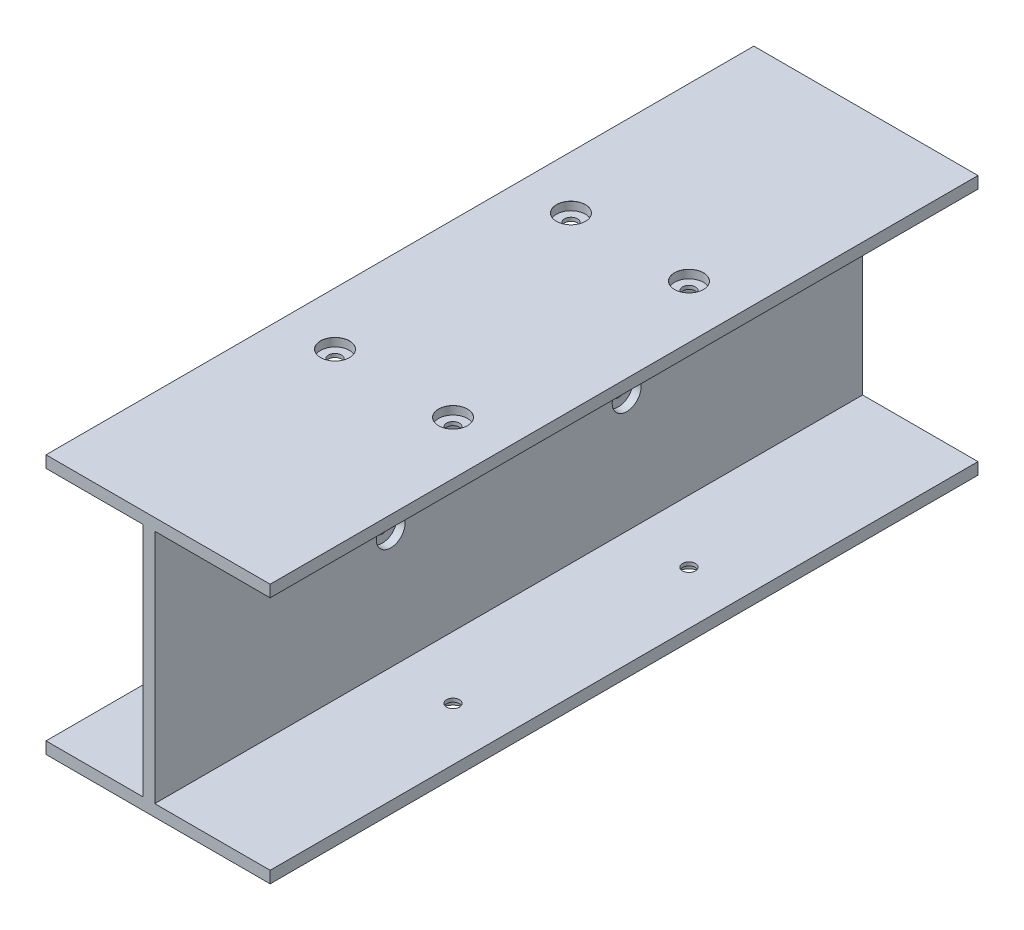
ISO-10303-21;
HEADER;
FILE_DESCRIPTION(('STEP AP214'),'2;1');
FILE_NAME('part.step','',(''),(''),'','','');
FILE_SCHEMA(('AUTOMOTIVE_DESIGN { 1 0 10303 214 1 1 1 1 }'));
ENDSEC;
DATA;
#1=APPLICATION_CONTEXT('core data for automotive mechanical design processes');
#2=APPLICATION_PROTOCOL_DEFINITION('international standard','automotive_design',2000,#1);
#3=PRODUCT_CONTEXT('',#1,'mechanical');
#4=PRODUCT('Part','Part','',(#3));
#5=PRODUCT_RELATED_PRODUCT_CATEGORY('part','',(#4));
#6=PRODUCT_DEFINITION_FORMATION('','',#4);
#7=PRODUCT_DEFINITION_CONTEXT('part definition',#1,'design');
#8=PRODUCT_DEFINITION('design','',#6,#7);
#9=PRODUCT_DEFINITION_SHAPE('','',#8);
#10=(LENGTH_UNIT() NAMED_UNIT(*) SI_UNIT(.MILLI.,.METRE.));
#11=(NAMED_UNIT(*) PLANE_ANGLE_UNIT() SI_UNIT($,.RADIAN.));
#12=(NAMED_UNIT(*) SI_UNIT($,.STERADIAN.) SOLID_ANGLE_UNIT());
#13=UNCERTAINTY_MEASURE_WITH_UNIT(LENGTH_MEASURE(1.E-05),#10,'distance_accuracy_value','');
#14=(GEOMETRIC_REPRESENTATION_CONTEXT(3) GLOBAL_UNCERTAINTY_ASSIGNED_CONTEXT((#13)) GLOBAL_UNIT_ASSIGNED_CONTEXT((#10,
#11,#12)) REPRESENTATION_CONTEXT('',''));
#15=CARTESIAN_POINT('',(0.,0.,0.));
#16=DIRECTION('',(0.,0.,1.));
#17=DIRECTION('',(1.,0.,0.));
#18=AXIS2_PLACEMENT_3D('',#15,#16,#17);
#19=CARTESIAN_POINT('',(47.5,50.,300.));
#20=DIRECTION('',(-1.,0.,0.));
#21=DIRECTION('',(0.,0.,1.));
#22=AXIS2_PLACEMENT_3D('',#19,#20,#21);
#23=PLANE('',#22);
#24=DIRECTION('',(0.,1.,0.));
#25=VECTOR('',#24,1.);
#26=CARTESIAN_POINT('',(47.5,50.,0.));
#27=LINE('',#26,#25);
#28=CARTESIAN_POINT('',(47.5,50.,0.));
#29=VERTEX_POINT('',#28);
#30=CARTESIAN_POINT('',(47.5,55.,0.));
#31=VERTEX_POINT('',#30);
#32=EDGE_CURVE('E154',#29,#31,#27,.T.);
#33=ORIENTED_EDGE('',*,*,#32,.T.);
#34=DIRECTION('',(0.,0.,-1.));
#35=VECTOR('',#34,1.);
#36=CARTESIAN_POINT('',(47.5,55.,300.));
#37=LINE('',#36,#35);
#38=CARTESIAN_POINT('',(47.5,55.,300.));
#39=VERTEX_POINT('',#38);
#40=EDGE_CURVE('E11',#39,#31,#37,.T.);
#41=ORIENTED_EDGE('',*,*,#40,.F.);
#42=DIRECTION('',(0.,1.,0.));
#43=VECTOR('',#42,1.);
#44=CARTESIAN_POINT('',(47.5,50.,300.));
#45=LINE('',#44,#43);
#46=CARTESIAN_POINT('',(47.5,50.,300.));
#47=VERTEX_POINT('',#46);
#48=EDGE_CURVE('E177',#47,#39,#45,.T.);
#49=ORIENTED_EDGE('',*,*,#48,.F.);
#50=DIRECTION('',(0.,0.,-1.));
#51=VECTOR('',#50,1.);
#52=CARTESIAN_POINT('',(47.5,50.,300.));
#53=LINE('',#52,#51);
#54=EDGE_CURVE('E150',#47,#29,#53,.T.);
#55=ORIENTED_EDGE('',*,*,#54,.T.);
#56=EDGE_LOOP('',(#33,#41,#49,#55));
#57=FACE_BOUND('',#56,.T.);
#58=ADVANCED_FACE('F32',(#57),#23,.F.);
#59=CARTESIAN_POINT('',(-47.5,55.,300.));
#60=DIRECTION('',(0.,-1.,0.));
#61=DIRECTION('',(0.,0.,-1.));
#62=AXIS2_PLACEMENT_3D('',#59,#60,#61);
#63=PLANE('',#62);
#64=CARTESIAN_POINT('',(-25.,55.,100.));
#65=DIRECTION('',(0.,1.,0.));
#66=DIRECTION('',(0.,0.,1.));
#67=AXIS2_PLACEMENT_3D('',#64,#65,#66);
#68=CIRCLE('',#67,6.144);
#69=CARTESIAN_POINT('',(-25.,55.,106.144));
#70=VERTEX_POINT('',#69);
#71=EDGE_CURVE('E215',#70,#70,#68,.T.);
#72=ORIENTED_EDGE('',*,*,#71,.F.);
#73=EDGE_LOOP('',(#72));
#74=FACE_BOUND('',#73,.T.);
#75=CARTESIAN_POINT('',(-25.,55.,200.));
#76=DIRECTION('',(0.,1.,0.));
#77=DIRECTION('',(0.,0.,1.));
#78=AXIS2_PLACEMENT_3D('',#75,#76,#77);
#79=CIRCLE('',#78,6.144);
#80=CARTESIAN_POINT('',(-25.,55.,206.144));
#81=VERTEX_POINT('',#80);
#82=EDGE_CURVE('E243',#81,#81,#79,.T.);
#83=ORIENTED_EDGE('',*,*,#82,.F.);
#84=EDGE_LOOP('',(#83));
#85=FACE_BOUND('',#84,.T.);
#86=CARTESIAN_POINT('',(25.,55.,100.));
#87=DIRECTION('',(0.,1.,0.));
#88=DIRECTION('',(0.,0.,1.));
#89=AXIS2_PLACEMENT_3D('',#86,#87,#88);
#90=CIRCLE('',#89,6.144);
#91=CARTESIAN_POINT('',(25.,55.,106.144));
#92=VERTEX_POINT('',#91);
#93=EDGE_CURVE('E207',#92,#92,#90,.T.);
#94=ORIENTED_EDGE('',*,*,#93,.F.);
#95=EDGE_LOOP('',(#94));
#96=FACE_BOUND('',#95,.T.);
#97=CARTESIAN_POINT('',(25.,55.,200.));
#98=DIRECTION('',(0.,1.,0.));
#99=DIRECTION('',(0.,0.,1.));
#100=AXIS2_PLACEMENT_3D('',#97,#98,#99);
#101=CIRCLE('',#100,6.144);
#102=CARTESIAN_POINT('',(25.,55.,206.144));
#103=VERTEX_POINT('',#102);
#104=EDGE_CURVE('E293',#103,#103,#101,.T.);
#105=ORIENTED_EDGE('',*,*,#104,.F.);
#106=EDGE_LOOP('',(#105));
#107=FACE_BOUND('',#106,.T.);
#108=DIRECTION('',(-1.,0.,0.));
#109=VECTOR('',#108,1.);
#110=CARTESIAN_POINT('',(-47.5,55.,0.));
#111=LINE('',#110,#109);
#112=CARTESIAN_POINT('',(-47.5,55.,0.));
#113=VERTEX_POINT('',#112);
#114=EDGE_CURVE('E157',#31,#113,#111,.T.);
#115=ORIENTED_EDGE('',*,*,#114,.T.);
#116=DIRECTION('',(0.,0.,-1.));
#117=VECTOR('',#116,1.);
#118=CARTESIAN_POINT('',(-47.5,55.,300.));
#119=LINE('',#118,#117);
#120=CARTESIAN_POINT('',(-47.5,55.,300.));
#121=VERTEX_POINT('',#120);
#122=EDGE_CURVE('E41',#121,#113,#119,.T.);
#123=ORIENTED_EDGE('',*,*,#122,.F.);
#124=DIRECTION('',(-1.,0.,0.));
#125=VECTOR('',#124,1.);
#126=CARTESIAN_POINT('',(-47.5,55.,300.));
#127=LINE('',#126,#125);
#128=EDGE_CURVE('E104',#39,#121,#127,.T.);
#129=ORIENTED_EDGE('',*,*,#128,.F.);
#130=ORIENTED_EDGE('',*,*,#40,.T.);
#131=EDGE_LOOP('',(#115,#123,#129,#130));
#132=FACE_BOUND('',#131,.T.);
#133=ADVANCED_FACE('F348',(#74,#85,#96,#107,#132),#63,.F.);
#134=CARTESIAN_POINT('',(-47.5,50.,300.));
#135=DIRECTION('',(1.,0.,0.));
#136=DIRECTION('',(0.,0.,-1.));
#137=AXIS2_PLACEMENT_3D('',#134,#135,#136);
#138=PLANE('',#137);
#139=DIRECTION('',(0.,-1.,0.));
#140=VECTOR('',#139,1.);
#141=CARTESIAN_POINT('',(-47.5,50.,0.));
#142=LINE('',#141,#140);
#143=CARTESIAN_POINT('',(-47.5,50.,0.));
#144=VERTEX_POINT('',#143);
#145=EDGE_CURVE('E160',#113,#144,#142,.T.);
#146=ORIENTED_EDGE('',*,*,#145,.T.);
#147=DIRECTION('',(0.,0.,-1.));
#148=VECTOR('',#147,1.);
#149=CARTESIAN_POINT('',(-47.5,50.,300.));
#150=LINE('',#149,#148);
#151=CARTESIAN_POINT('',(-47.5,50.,300.));
#152=VERTEX_POINT('',#151);
#153=EDGE_CURVE('E196',#152,#144,#150,.T.);
#154=ORIENTED_EDGE('',*,*,#153,.F.);
#155=DIRECTION('',(0.,-1.,0.));
#156=VECTOR('',#155,1.);
#157=CARTESIAN_POINT('',(-47.5,50.,300.));
#158=LINE('',#157,#156);
#159=EDGE_CURVE('E306',#121,#152,#158,.T.);
#160=ORIENTED_EDGE('',*,*,#159,.F.);
#161=ORIENTED_EDGE('',*,*,#122,.T.);
#162=EDGE_LOOP('',(#146,#154,#160,#161));
#163=FACE_BOUND('',#162,.T.);
#164=ADVANCED_FACE('F352',(#163),#138,.F.);
#165=CARTESIAN_POINT('',(-47.5,50.,300.));
#166=DIRECTION('',(0.,1.,0.));
#167=DIRECTION('',(-1.,0.,0.));
#168=AXIS2_PLACEMENT_3D('',#165,#166,#167);
#169=PLANE('',#168);
#170=CARTESIAN_POINT('',(-25.,50.,100.));
#171=DIRECTION('',(0.,1.,0.));
#172=DIRECTION('',(-1.,0.,0.));
#173=AXIS2_PLACEMENT_3D('',#170,#171,#172);
#174=CIRCLE('',#173,2.75);
#175=CARTESIAN_POINT('',(-27.75,50.,100.));
#176=VERTEX_POINT('',#175);
#177=EDGE_CURVE('E220',#176,#176,#174,.T.);
#178=ORIENTED_EDGE('',*,*,#177,.T.);
#179=EDGE_LOOP('',(#178));
#180=FACE_BOUND('',#179,.T.);
#181=CARTESIAN_POINT('',(-25.,50.,200.));
#182=DIRECTION('',(0.,1.,0.));
#183=DIRECTION('',(-1.,0.,0.));
#184=AXIS2_PLACEMENT_3D('',#181,#182,#183);
#185=CIRCLE('',#184,2.75);
#186=CARTESIAN_POINT('',(-27.75,50.,200.));
#187=VERTEX_POINT('',#186);
#188=EDGE_CURVE('E209',#187,#187,#185,.T.);
#189=ORIENTED_EDGE('',*,*,#188,.T.);
#190=EDGE_LOOP('',(#189));
#191=FACE_BOUND('',#190,.T.);
#192=DIRECTION('',(1.,0.,0.));
#193=VECTOR('',#192,1.);
#194=CARTESIAN_POINT('',(-47.5,50.,0.));
#195=LINE('',#194,#193);
#196=CARTESIAN_POINT('',(-6.40742595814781,50.,0.));
#197=VERTEX_POINT('',#196);
#198=EDGE_CURVE('E162',#144,#197,#195,.T.);
#199=ORIENTED_EDGE('',*,*,#198,.T.);
#200=DIRECTION('',(0.,0.,-1.));
#201=VECTOR('',#200,1.);
#202=CARTESIAN_POINT('',(-6.40742595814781,50.,300.));
#203=LINE('',#202,#201);
#204=CARTESIAN_POINT('',(-6.40742595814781,50.,300.));
#205=VERTEX_POINT('',#204);
#206=EDGE_CURVE('E193',#205,#197,#203,.T.);
#207=ORIENTED_EDGE('',*,*,#206,.F.);
#208=DIRECTION('',(1.,0.,0.));
#209=VECTOR('',#208,1.);
#210=CARTESIAN_POINT('',(-47.5,50.,300.));
#211=LINE('',#210,#209);
#212=EDGE_CURVE('E308',#152,#205,#211,.T.);
#213=ORIENTED_EDGE('',*,*,#212,.F.);
#214=ORIENTED_EDGE('',*,*,#153,.T.);
#215=EDGE_LOOP('',(#199,#207,#213,#214));
#216=FACE_BOUND('',#215,.T.);
#217=ADVANCED_FACE('F357',(#180,#191,#216),#169,.F.);
#218=CARTESIAN_POINT('',(-6.40742595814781,50.,300.));
#219=DIRECTION('',(1.,0.,0.));
#220=DIRECTION('',(0.,1.,0.));
#221=AXIS2_PLACEMENT_3D('',#218,#219,#220);
#222=PLANE('',#221);
#223=CARTESIAN_POINT('',(-6.40742595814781,0.,100.));
#224=DIRECTION('',(1.,0.,0.));
#225=DIRECTION('',(0.,1.,0.));
#226=AXIS2_PLACEMENT_3D('',#223,#224,#225);
#227=CIRCLE('',#226,2.75);
#228=CARTESIAN_POINT('',(-6.40742595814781,2.75,100.));
#229=VERTEX_POINT('',#228);
#230=EDGE_CURVE('E814',#229,#229,#227,.T.);
#231=ORIENTED_EDGE('',*,*,#230,.T.);
#232=EDGE_LOOP('',(#231));
#233=FACE_BOUND('',#232,.T.);
#234=CARTESIAN_POINT('',(-6.40742595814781,0.,200.));
#235=DIRECTION('',(1.,0.,0.));
#236=DIRECTION('',(0.,1.,0.));
#237=AXIS2_PLACEMENT_3D('',#234,#235,#236);
#238=CIRCLE('',#237,2.75);
#239=CARTESIAN_POINT('',(-6.40742595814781,2.75,200.));
#240=VERTEX_POINT('',#239);
#241=EDGE_CURVE('E35',#240,#240,#238,.T.);
#242=ORIENTED_EDGE('',*,*,#241,.T.);
#243=EDGE_LOOP('',(#242));
#244=FACE_BOUND('',#243,.T.);
#245=DIRECTION('',(0.,-1.,0.));
#246=VECTOR('',#245,1.);
#247=CARTESIAN_POINT('',(-6.40742595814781,50.,0.));
#248=LINE('',#247,#246);
#249=CARTESIAN_POINT('',(-6.4074259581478,-50.,0.));
#250=VERTEX_POINT('',#249);
#251=EDGE_CURVE('E164',#197,#250,#248,.T.);
#252=ORIENTED_EDGE('',*,*,#251,.T.);
#253=DIRECTION('',(0.,0.,-1.));
#254=VECTOR('',#253,1.);
#255=CARTESIAN_POINT('',(-6.4074259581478,-50.,300.));
#256=LINE('',#255,#254);
#257=CARTESIAN_POINT('',(-6.4074259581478,-50.,300.));
#258=VERTEX_POINT('',#257);
#259=EDGE_CURVE('E190',#258,#250,#256,.T.);
#260=ORIENTED_EDGE('',*,*,#259,.F.);
#261=DIRECTION('',(0.,-1.,0.));
#262=VECTOR('',#261,1.);
#263=CARTESIAN_POINT('',(-6.40742595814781,50.,300.));
#264=LINE('',#263,#262);
#265=EDGE_CURVE('E310',#205,#258,#264,.T.);
#266=ORIENTED_EDGE('',*,*,#265,.F.);
#267=ORIENTED_EDGE('',*,*,#206,.T.);
#268=EDGE_LOOP('',(#252,#260,#266,#267));
#269=FACE_BOUND('',#268,.T.);
#270=ADVANCED_FACE('F365',(#233,#244,#269),#222,.F.);
#271=CARTESIAN_POINT('',(-47.5,-50.,300.));
#272=DIRECTION('',(0.,-1.,0.));
#273=DIRECTION('',(0.,0.,-1.));
#274=AXIS2_PLACEMENT_3D('',#271,#272,#273);
#275=PLANE('',#274);
#276=CARTESIAN_POINT('',(-25.,-50.,100.));
#277=DIRECTION('',(0.,-1.,0.));
#278=DIRECTION('',(0.,0.,-1.));
#279=AXIS2_PLACEMENT_3D('',#276,#277,#278);
#280=CIRCLE('',#279,2.75);
#281=CARTESIAN_POINT('',(-25.,-50.,97.25));
#282=VERTEX_POINT('',#281);
#283=EDGE_CURVE('E835',#282,#282,#280,.T.);
#284=ORIENTED_EDGE('',*,*,#283,.T.);
#285=EDGE_LOOP('',(#284));
#286=FACE_BOUND('',#285,.T.);
#287=CARTESIAN_POINT('',(-25.,-50.,200.));
#288=DIRECTION('',(0.,-1.,0.));
#289=DIRECTION('',(0.,0.,-1.));
#290=AXIS2_PLACEMENT_3D('',#287,#288,#289);
#291=CIRCLE('',#290,2.75);
#292=CARTESIAN_POINT('',(-25.,-50.,197.25));
#293=VERTEX_POINT('',#292);
#294=EDGE_CURVE('E213',#293,#293,#291,.T.);
#295=ORIENTED_EDGE('',*,*,#294,.T.);
#296=EDGE_LOOP('',(#295));
#297=FACE_BOUND('',#296,.T.);
#298=DIRECTION('',(-1.,0.,0.));
#299=VECTOR('',#298,1.);
#300=CARTESIAN_POINT('',(-47.5,-50.,0.));
#301=LINE('',#300,#299);
#302=CARTESIAN_POINT('',(-47.5,-50.,0.));
#303=VERTEX_POINT('',#302);
#304=EDGE_CURVE('E166',#250,#303,#301,.T.);
#305=ORIENTED_EDGE('',*,*,#304,.T.);
#306=DIRECTION('',(0.,0.,-1.));
#307=VECTOR('',#306,1.);
#308=CARTESIAN_POINT('',(-47.5,-50.,300.));
#309=LINE('',#308,#307);
#310=CARTESIAN_POINT('',(-47.5,-50.,300.));
#311=VERTEX_POINT('',#310);
#312=EDGE_CURVE('E187',#311,#303,#309,.T.);
#313=ORIENTED_EDGE('',*,*,#312,.F.);
#314=DIRECTION('',(-1.,0.,0.));
#315=VECTOR('',#314,1.);
#316=CARTESIAN_POINT('',(-47.5,-50.,300.));
#317=LINE('',#316,#315);
#318=EDGE_CURVE('E312',#258,#311,#317,.T.);
#319=ORIENTED_EDGE('',*,*,#318,.F.);
#320=ORIENTED_EDGE('',*,*,#259,.T.);
#321=EDGE_LOOP('',(#305,#313,#319,#320));
#322=FACE_BOUND('',#321,.T.);
#323=ADVANCED_FACE('F369',(#286,#297,#322),#275,.F.);
#324=CARTESIAN_POINT('',(-47.5,-55.,300.));
#325=DIRECTION('',(1.,0.,0.));
#326=DIRECTION('',(0.,0.,-1.));
#327=AXIS2_PLACEMENT_3D('',#324,#325,#326);
#328=PLANE('',#327);
#329=DIRECTION('',(0.,-1.,0.));
#330=VECTOR('',#329,1.);
#331=CARTESIAN_POINT('',(-47.5,-55.,0.));
#332=LINE('',#331,#330);
#333=CARTESIAN_POINT('',(-47.5,-55.,0.));
#334=VERTEX_POINT('',#333);
#335=EDGE_CURVE('E168',#303,#334,#332,.T.);
#336=ORIENTED_EDGE('',*,*,#335,.T.);
#337=DIRECTION('',(0.,0.,-1.));
#338=VECTOR('',#337,1.);
#339=CARTESIAN_POINT('',(-47.5,-55.,300.));
#340=LINE('',#339,#338);
#341=CARTESIAN_POINT('',(-47.5,-55.,300.));
#342=VERTEX_POINT('',#341);
#343=EDGE_CURVE('E184',#342,#334,#340,.T.);
#344=ORIENTED_EDGE('',*,*,#343,.F.);
#345=DIRECTION('',(0.,-1.,0.));
#346=VECTOR('',#345,1.);
#347=CARTESIAN_POINT('',(-47.5,-55.,300.));
#348=LINE('',#347,#346);
#349=EDGE_CURVE('E314',#311,#342,#348,.T.);
#350=ORIENTED_EDGE('',*,*,#349,.F.);
#351=ORIENTED_EDGE('',*,*,#312,.T.);
#352=EDGE_LOOP('',(#336,#344,#350,#351));
#353=FACE_BOUND('',#352,.T.);
#354=ADVANCED_FACE('F373',(#353),#328,.F.);
#355=CARTESIAN_POINT('',(-47.5,-55.,300.));
#356=DIRECTION('',(0.,1.,0.));
#357=DIRECTION('',(0.,0.,1.));
#358=AXIS2_PLACEMENT_3D('',#355,#356,#357);
#359=PLANE('',#358);
#360=CARTESIAN_POINT('',(-25.,-55.,100.));
#361=DIRECTION('',(0.,-1.,0.));
#362=DIRECTION('',(0.,0.,-1.));
#363=AXIS2_PLACEMENT_3D('',#360,#361,#362);
#364=CIRCLE('',#363,6.144);
#365=CARTESIAN_POINT('',(-25.,-55.,93.856));
#366=VERTEX_POINT('',#365);
#367=EDGE_CURVE('E832',#366,#366,#364,.T.);
#368=ORIENTED_EDGE('',*,*,#367,.F.);
#369=EDGE_LOOP('',(#368));
#370=FACE_BOUND('',#369,.T.);
#371=CARTESIAN_POINT('',(-25.,-55.,200.));
#372=DIRECTION('',(0.,-1.,0.));
#373=DIRECTION('',(0.,0.,-1.));
#374=AXIS2_PLACEMENT_3D('',#371,#372,#373);
#375=CIRCLE('',#374,6.144);
#376=CARTESIAN_POINT('',(-25.,-55.,193.856));
#377=VERTEX_POINT('',#376);
#378=EDGE_CURVE('E847',#377,#377,#375,.T.);
#379=ORIENTED_EDGE('',*,*,#378,.F.);
#380=EDGE_LOOP('',(#379));
#381=FACE_BOUND('',#380,.T.);
#382=CARTESIAN_POINT('',(25.,-55.,100.));
#383=DIRECTION('',(0.,-1.,0.));
#384=DIRECTION('',(0.,0.,-1.));
#385=AXIS2_PLACEMENT_3D('',#382,#383,#384);
#386=CIRCLE('',#385,6.144);
#387=CARTESIAN_POINT('',(25.,-55.,93.856));
#388=VERTEX_POINT('',#387);
#389=EDGE_CURVE('E211',#388,#388,#386,.T.);
#390=ORIENTED_EDGE('',*,*,#389,.F.);
#391=EDGE_LOOP('',(#390));
#392=FACE_BOUND('',#391,.T.);
#393=CARTESIAN_POINT('',(25.,-55.,200.));
#394=DIRECTION('',(0.,-1.,0.));
#395=DIRECTION('',(0.,0.,-1.));
#396=AXIS2_PLACEMENT_3D('',#393,#394,#395);
#397=CIRCLE('',#396,6.144);
#398=CARTESIAN_POINT('',(25.,-55.,193.856));
#399=VERTEX_POINT('',#398);
#400=EDGE_CURVE('E268',#399,#399,#397,.T.);
#401=ORIENTED_EDGE('',*,*,#400,.F.);
#402=EDGE_LOOP('',(#401));
#403=FACE_BOUND('',#402,.T.);
#404=DIRECTION('',(1.,0.,0.));
#405=VECTOR('',#404,1.);
#406=CARTESIAN_POINT('',(-47.5,-55.,0.));
#407=LINE('',#406,#405);
#408=CARTESIAN_POINT('',(47.5,-55.,0.));
#409=VERTEX_POINT('',#408);
#410=EDGE_CURVE('E170',#334,#409,#407,.T.);
#411=ORIENTED_EDGE('',*,*,#410,.T.);
#412=DIRECTION('',(0.,0.,-1.));
#413=VECTOR('',#412,1.);
#414=CARTESIAN_POINT('',(47.5,-55.,300.));
#415=LINE('',#414,#413);
#416=CARTESIAN_POINT('',(47.5,-55.,300.));
#417=VERTEX_POINT('',#416);
#418=EDGE_CURVE('E181',#417,#409,#415,.T.);
#419=ORIENTED_EDGE('',*,*,#418,.F.);
#420=DIRECTION('',(1.,0.,0.));
#421=VECTOR('',#420,1.);
#422=CARTESIAN_POINT('',(-47.5,-55.,300.));
#423=LINE('',#422,#421);
#424=EDGE_CURVE('E316',#342,#417,#423,.T.);
#425=ORIENTED_EDGE('',*,*,#424,.F.);
#426=ORIENTED_EDGE('',*,*,#343,.T.);
#427=EDGE_LOOP('',(#411,#419,#425,#426));
#428=FACE_BOUND('',#427,.T.);
#429=ADVANCED_FACE('F322',(#370,#381,#392,#403,#428),#359,.F.);
#430=CARTESIAN_POINT('',(47.5,-55.,300.));
#431=DIRECTION('',(-1.,0.,0.));
#432=DIRECTION('',(0.,-1.,0.));
#433=AXIS2_PLACEMENT_3D('',#430,#431,#432);
#434=PLANE('',#433);
#435=DIRECTION('',(0.,1.,0.));
#436=VECTOR('',#435,1.);
#437=CARTESIAN_POINT('',(47.5,-55.,0.));
#438=LINE('',#437,#436);
#439=CARTESIAN_POINT('',(47.5,-50.,0.));
#440=VERTEX_POINT('',#439);
#441=EDGE_CURVE('E172',#409,#440,#438,.T.);
#442=ORIENTED_EDGE('',*,*,#441,.T.);
#443=DIRECTION('',(0.,0.,-1.));
#444=VECTOR('',#443,1.);
#445=CARTESIAN_POINT('',(47.5,-50.,300.));
#446=LINE('',#445,#444);
#447=CARTESIAN_POINT('',(47.5,-50.,300.));
#448=VERTEX_POINT('',#447);
#449=EDGE_CURVE('E145',#448,#440,#446,.T.);
#450=ORIENTED_EDGE('',*,*,#449,.F.);
#451=DIRECTION('',(0.,1.,0.));
#452=VECTOR('',#451,1.);
#453=CARTESIAN_POINT('',(47.5,-55.,300.));
#454=LINE('',#453,#452);
#455=EDGE_CURVE('E135',#417,#448,#454,.T.);
#456=ORIENTED_EDGE('',*,*,#455,.F.);
#457=ORIENTED_EDGE('',*,*,#418,.T.);
#458=EDGE_LOOP('',(#442,#450,#456,#457));
#459=FACE_BOUND('',#458,.T.);
#460=ADVANCED_FACE('F326',(#459),#434,.F.);
#461=CARTESIAN_POINT('',(-1.40742595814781,-50.,300.));
#462=DIRECTION('',(0.,-1.,0.));
#463=DIRECTION('',(0.,0.,-1.));
#464=AXIS2_PLACEMENT_3D('',#461,#462,#463);
#465=PLANE('',#464);
#466=CARTESIAN_POINT('',(25.,-50.,100.));
#467=DIRECTION('',(0.,-1.,0.));
#468=DIRECTION('',(0.,0.,-1.));
#469=AXIS2_PLACEMENT_3D('',#466,#467,#468);
#470=CIRCLE('',#469,2.75);
#471=CARTESIAN_POINT('',(25.,-50.,97.25));
#472=VERTEX_POINT('',#471);
#473=EDGE_CURVE('E256',#472,#472,#470,.T.);
#474=ORIENTED_EDGE('',*,*,#473,.T.);
#475=EDGE_LOOP('',(#474));
#476=FACE_BOUND('',#475,.T.);
#477=CARTESIAN_POINT('',(25.,-50.,200.));
#478=DIRECTION('',(0.,-1.,0.));
#479=DIRECTION('',(0.,0.,-1.));
#480=AXIS2_PLACEMENT_3D('',#477,#478,#479);
#481=CIRCLE('',#480,2.75);
#482=CARTESIAN_POINT('',(25.,-50.,197.25));
#483=VERTEX_POINT('',#482);
#484=EDGE_CURVE('E204',#483,#483,#481,.T.);
#485=ORIENTED_EDGE('',*,*,#484,.T.);
#486=EDGE_LOOP('',(#485));
#487=FACE_BOUND('',#486,.T.);
#488=DIRECTION('',(-1.,0.,0.));
#489=VECTOR('',#488,1.);
#490=CARTESIAN_POINT('',(-1.40742595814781,-50.,0.));
#491=LINE('',#490,#489);
#492=CARTESIAN_POINT('',(-1.40742595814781,-50.,0.));
#493=VERTEX_POINT('',#492);
#494=EDGE_CURVE('E144',#440,#493,#491,.T.);
#495=ORIENTED_EDGE('',*,*,#494,.T.);
#496=DIRECTION('',(0.,0.,-1.));
#497=VECTOR('',#496,1.);
#498=CARTESIAN_POINT('',(-1.40742595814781,-50.,300.));
#499=LINE('',#498,#497);
#500=CARTESIAN_POINT('',(-1.40742595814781,-50.,300.));
#501=VERTEX_POINT('',#500);
#502=EDGE_CURVE('E141',#501,#493,#499,.T.);
#503=ORIENTED_EDGE('',*,*,#502,.F.);
#504=DIRECTION('',(-1.,0.,0.));
#505=VECTOR('',#504,1.);
#506=CARTESIAN_POINT('',(-1.40742595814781,-50.,300.));
#507=LINE('',#506,#505);
#508=EDGE_CURVE('E129',#448,#501,#507,.T.);
#509=ORIENTED_EDGE('',*,*,#508,.F.);
#510=ORIENTED_EDGE('',*,*,#449,.T.);
#511=EDGE_LOOP('',(#495,#503,#509,#510));
#512=FACE_BOUND('',#511,.T.);
#513=ADVANCED_FACE('F142',(#476,#487,#512),#465,.F.);
#514=CARTESIAN_POINT('',(-1.40742595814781,50.,300.));
#515=DIRECTION('',(-1.,0.,0.));
#516=DIRECTION('',(0.,-1.,0.));
#517=AXIS2_PLACEMENT_3D('',#514,#515,#516);
#518=PLANE('',#517);
#519=CARTESIAN_POINT('',(-1.40742595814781,0.,100.));
#520=DIRECTION('',(1.,0.,0.));
#521=DIRECTION('',(0.,0.,-1.));
#522=AXIS2_PLACEMENT_3D('',#519,#520,#521);
#523=CIRCLE('',#522,6.119);
#524=CARTESIAN_POINT('',(-1.40742595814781,0.,93.881));
#525=VERTEX_POINT('',#524);
#526=EDGE_CURVE('E813',#525,#525,#523,.T.);
#527=ORIENTED_EDGE('',*,*,#526,.F.);
#528=EDGE_LOOP('',(#527));
#529=FACE_BOUND('',#528,.T.);
#530=CARTESIAN_POINT('',(-1.40742595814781,0.,200.));
#531=DIRECTION('',(1.,0.,0.));
#532=DIRECTION('',(0.,0.,-1.));
#533=AXIS2_PLACEMENT_3D('',#530,#531,#532);
#534=CIRCLE('',#533,6.119);
#535=CARTESIAN_POINT('',(-1.40742595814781,0.,193.881));
#536=VERTEX_POINT('',#535);
#537=EDGE_CURVE('E823',#536,#536,#534,.T.);
#538=ORIENTED_EDGE('',*,*,#537,.F.);
#539=EDGE_LOOP('',(#538));
#540=FACE_BOUND('',#539,.T.);
#541=DIRECTION('',(0.,1.,0.));
#542=VECTOR('',#541,1.);
#543=CARTESIAN_POINT('',(-1.40742595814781,50.,0.));
#544=LINE('',#543,#542);
#545=CARTESIAN_POINT('',(-1.40742595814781,50.,0.));
#546=VERTEX_POINT('',#545);
#547=EDGE_CURVE('E90',#493,#546,#544,.T.);
#548=ORIENTED_EDGE('',*,*,#547,.T.);
#549=DIRECTION('',(0.,0.,-1.));
#550=VECTOR('',#549,1.);
#551=CARTESIAN_POINT('',(-1.40742595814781,50.,300.));
#552=LINE('',#551,#550);
#553=CARTESIAN_POINT('',(-1.40742595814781,50.,300.));
#554=VERTEX_POINT('',#553);
#555=EDGE_CURVE('E146',#554,#546,#552,.T.);
#556=ORIENTED_EDGE('',*,*,#555,.F.);
#557=DIRECTION('',(0.,1.,0.));
#558=VECTOR('',#557,1.);
#559=CARTESIAN_POINT('',(-1.40742595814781,1.62965110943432,300.));
#560=LINE('',#559,#558);
#561=EDGE_CURVE('E133',#501,#554,#560,.T.);
#562=ORIENTED_EDGE('',*,*,#561,.F.);
#563=ORIENTED_EDGE('',*,*,#502,.T.);
#564=EDGE_LOOP('',(#548,#556,#562,#563));
#565=FACE_BOUND('',#564,.T.);
#566=ADVANCED_FACE('F148',(#529,#540,#565),#518,.F.);
#567=CARTESIAN_POINT('',(-1.40742595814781,50.,300.));
#568=DIRECTION('',(0.,1.,0.));
#569=DIRECTION('',(0.,0.,1.));
#570=AXIS2_PLACEMENT_3D('',#567,#568,#569);
#571=PLANE('',#570);
#572=CARTESIAN_POINT('',(25.,50.,100.));
#573=DIRECTION('',(0.,1.,0.));
#574=DIRECTION('',(0.,0.,1.));
#575=AXIS2_PLACEMENT_3D('',#572,#573,#574);
#576=CIRCLE('',#575,2.75);
#577=CARTESIAN_POINT('',(25.,50.,102.75));
#578=VERTEX_POINT('',#577);
#579=EDGE_CURVE('E281',#578,#578,#576,.T.);
#580=ORIENTED_EDGE('',*,*,#579,.T.);
#581=EDGE_LOOP('',(#580));
#582=FACE_BOUND('',#581,.T.);
#583=CARTESIAN_POINT('',(25.,50.,200.));
#584=DIRECTION('',(0.,1.,0.));
#585=DIRECTION('',(0.,0.,1.));
#586=AXIS2_PLACEMENT_3D('',#583,#584,#585);
#587=CIRCLE('',#586,2.75);
#588=CARTESIAN_POINT('',(25.,50.,202.75));
#589=VERTEX_POINT('',#588);
#590=EDGE_CURVE('E158',#589,#589,#587,.T.);
#591=ORIENTED_EDGE('',*,*,#590,.T.);
#592=EDGE_LOOP('',(#591));
#593=FACE_BOUND('',#592,.T.);
#594=DIRECTION('',(1.,0.,0.));
#595=VECTOR('',#594,1.);
#596=CARTESIAN_POINT('',(-1.40742595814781,50.,0.));
#597=LINE('',#596,#595);
#598=EDGE_CURVE('E96',#546,#29,#597,.T.);
#599=ORIENTED_EDGE('',*,*,#598,.T.);
#600=ORIENTED_EDGE('',*,*,#54,.F.);
#601=DIRECTION('',(1.,0.,0.));
#602=VECTOR('',#601,1.);
#603=CARTESIAN_POINT('',(-1.40742595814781,50.,300.));
#604=LINE('',#603,#602);
#605=EDGE_CURVE('E50',#554,#47,#604,.T.);
#606=ORIENTED_EDGE('',*,*,#605,.F.);
#607=ORIENTED_EDGE('',*,*,#555,.T.);
#608=EDGE_LOOP('',(#599,#600,#606,#607));
#609=FACE_BOUND('',#608,.T.);
#610=ADVANCED_FACE('F334',(#582,#593,#609),#571,.F.);
#611=CARTESIAN_POINT('',(0.,0.,300.));
#612=DIRECTION('',(0.,0.,-1.));
#613=DIRECTION('',(-1.,0.,0.));
#614=AXIS2_PLACEMENT_3D('',#611,#612,#613);
#615=PLANE('',#614);
#616=ORIENTED_EDGE('',*,*,#48,.T.);
#617=ORIENTED_EDGE('',*,*,#128,.T.);
#618=ORIENTED_EDGE('',*,*,#159,.T.);
#619=ORIENTED_EDGE('',*,*,#212,.T.);
#620=ORIENTED_EDGE('',*,*,#265,.T.);
#621=ORIENTED_EDGE('',*,*,#318,.T.);
#622=ORIENTED_EDGE('',*,*,#349,.T.);
#623=ORIENTED_EDGE('',*,*,#424,.T.);
#624=ORIENTED_EDGE('',*,*,#455,.T.);
#625=ORIENTED_EDGE('',*,*,#508,.T.);
#626=ORIENTED_EDGE('',*,*,#561,.T.);
#627=ORIENTED_EDGE('',*,*,#605,.T.);
#628=EDGE_LOOP('',(#616,#617,#618,#619,#620,#621,#622,#623,#624,#625,#626,#627));
#629=FACE_BOUND('',#628,.T.);
#630=ADVANCED_FACE('F131',(#629),#615,.F.);
#631=CARTESIAN_POINT('',(0.,0.,0.));
#632=DIRECTION('',(0.,0.,-1.));
#633=DIRECTION('',(-1.,0.,0.));
#634=AXIS2_PLACEMENT_3D('',#631,#632,#633);
#635=PLANE('',#634);
#636=ORIENTED_EDGE('',*,*,#32,.F.);
#637=ORIENTED_EDGE('',*,*,#598,.F.);
#638=ORIENTED_EDGE('',*,*,#547,.F.);
#639=ORIENTED_EDGE('',*,*,#494,.F.);
#640=ORIENTED_EDGE('',*,*,#441,.F.);
#641=ORIENTED_EDGE('',*,*,#410,.F.);
#642=ORIENTED_EDGE('',*,*,#335,.F.);
#643=ORIENTED_EDGE('',*,*,#304,.F.);
#644=ORIENTED_EDGE('',*,*,#251,.F.);
#645=ORIENTED_EDGE('',*,*,#198,.F.);
#646=ORIENTED_EDGE('',*,*,#145,.F.);
#647=ORIENTED_EDGE('',*,*,#114,.F.);
#648=EDGE_LOOP('',(#636,#637,#638,#639,#640,#641,#642,#643,#644,#645,#646,#647));
#649=FACE_BOUND('',#648,.T.);
#650=ADVANCED_FACE('F329',(#649),#635,.T.);
#651=CARTESIAN_POINT('',(25.,55.,200.));
#652=DIRECTION('',(0.,1.,0.));
#653=DIRECTION('',(0.,0.,1.));
#654=AXIS2_PLACEMENT_3D('',#651,#652,#653);
#655=CYLINDRICAL_SURFACE('',#654,2.75);
#656=CARTESIAN_POINT('',(25.,51.5,200.));
#657=DIRECTION('',(0.,1.,0.));
#658=DIRECTION('',(0.,0.,1.));
#659=AXIS2_PLACEMENT_3D('',#656,#657,#658);
#660=CIRCLE('',#659,2.75);
#661=CARTESIAN_POINT('',(25.,51.5,202.75));
#662=VERTEX_POINT('',#661);
#663=EDGE_CURVE('E203',#662,#662,#660,.T.);
#664=ORIENTED_EDGE('',*,*,#663,.T.);
#665=EDGE_LOOP('',(#664));
#666=FACE_BOUND('',#665,.T.);
#667=ORIENTED_EDGE('',*,*,#590,.F.);
#668=EDGE_LOOP('',(#667));
#669=FACE_BOUND('',#668,.T.);
#670=ADVANCED_FACE('F431',(#666,#669),#655,.F.);
#671=CARTESIAN_POINT('',(27.75,51.5,200.));
#672=DIRECTION('',(0.,-1.,0.));
#673=DIRECTION('',(0.,0.,-1.));
#674=AXIS2_PLACEMENT_3D('',#671,#672,#673);
#675=PLANE('',#674);
#676=ORIENTED_EDGE('',*,*,#663,.F.);
#677=EDGE_LOOP('',(#676));
#678=FACE_BOUND('',#677,.T.);
#679=CARTESIAN_POINT('',(25.,51.5,200.));
#680=DIRECTION('',(0.,1.,0.));
#681=DIRECTION('',(0.,0.,1.));
#682=AXIS2_PLACEMENT_3D('',#679,#680,#681);
#683=CIRCLE('',#682,6.119);
#684=CARTESIAN_POINT('',(25.,51.5,206.119));
#685=VERTEX_POINT('',#684);
#686=EDGE_CURVE('E299',#685,#685,#683,.T.);
#687=ORIENTED_EDGE('',*,*,#686,.T.);
#688=EDGE_LOOP('',(#687));
#689=FACE_BOUND('',#688,.T.);
#690=ADVANCED_FACE('F427',(#678,#689),#675,.F.);
#691=CARTESIAN_POINT('',(25.,55.,200.));
#692=DIRECTION('',(0.,1.,0.));
#693=DIRECTION('',(0.,0.,1.));
#694=AXIS2_PLACEMENT_3D('',#691,#692,#693);
#695=CYLINDRICAL_SURFACE('',#694,6.119);
#696=ORIENTED_EDGE('',*,*,#686,.F.);
#697=EDGE_LOOP('',(#696));
#698=FACE_BOUND('',#697,.T.);
#699=CARTESIAN_POINT('',(25.,54.975,200.));
#700=DIRECTION('',(0.,1.,0.));
#701=DIRECTION('',(0.,0.,1.));
#702=AXIS2_PLACEMENT_3D('',#699,#700,#701);
#703=CIRCLE('',#702,6.119);
#704=CARTESIAN_POINT('',(25.,54.975,206.119));
#705=VERTEX_POINT('',#704);
#706=EDGE_CURVE('E296',#705,#705,#703,.T.);
#707=ORIENTED_EDGE('',*,*,#706,.T.);
#708=EDGE_LOOP('',(#707));
#709=FACE_BOUND('',#708,.T.);
#710=ADVANCED_FACE('F423',(#698,#709),#695,.F.);
#711=CARTESIAN_POINT('',(25.,55.,200.));
#712=DIRECTION('',(0.,1.,0.));
#713=DIRECTION('',(0.,0.,1.));
#714=AXIS2_PLACEMENT_3D('',#711,#712,#713);
#715=CONICAL_SURFACE('',#714,6.144,0.785398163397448);
#716=ORIENTED_EDGE('',*,*,#706,.F.);
#717=EDGE_LOOP('',(#716));
#718=FACE_BOUND('',#717,.T.);
#719=ORIENTED_EDGE('',*,*,#104,.T.);
#720=EDGE_LOOP('',(#719));
#721=FACE_BOUND('',#720,.T.);
#722=ADVANCED_FACE('F419',(#718,#721),#715,.F.);
#723=CARTESIAN_POINT('',(25.,55.,100.));
#724=DIRECTION('',(0.,1.,0.));
#725=DIRECTION('',(0.,0.,1.));
#726=AXIS2_PLACEMENT_3D('',#723,#724,#725);
#727=CYLINDRICAL_SURFACE('',#726,2.75);
#728=CARTESIAN_POINT('',(25.,51.5,100.));
#729=DIRECTION('',(0.,1.,0.));
#730=DIRECTION('',(0.,0.,1.));
#731=AXIS2_PLACEMENT_3D('',#728,#729,#730);
#732=CIRCLE('',#731,2.75);
#733=CARTESIAN_POINT('',(25.,51.5,102.75));
#734=VERTEX_POINT('',#733);
#735=EDGE_CURVE('E290',#734,#734,#732,.T.);
#736=ORIENTED_EDGE('',*,*,#735,.T.);
#737=EDGE_LOOP('',(#736));
#738=FACE_BOUND('',#737,.T.);
#739=ORIENTED_EDGE('',*,*,#579,.F.);
#740=EDGE_LOOP('',(#739));
#741=FACE_BOUND('',#740,.T.);
#742=ADVANCED_FACE('F415',(#738,#741),#727,.F.);
#743=CARTESIAN_POINT('',(27.75,51.5,100.));
#744=DIRECTION('',(0.,-1.,0.));
#745=DIRECTION('',(0.,0.,-1.));
#746=AXIS2_PLACEMENT_3D('',#743,#744,#745);
#747=PLANE('',#746);
#748=ORIENTED_EDGE('',*,*,#735,.F.);
#749=EDGE_LOOP('',(#748));
#750=FACE_BOUND('',#749,.T.);
#751=CARTESIAN_POINT('',(25.,51.5,100.));
#752=DIRECTION('',(0.,1.,0.));
#753=DIRECTION('',(0.,0.,1.));
#754=AXIS2_PLACEMENT_3D('',#751,#752,#753);
#755=CIRCLE('',#754,6.119);
#756=CARTESIAN_POINT('',(25.,51.5,106.119));
#757=VERTEX_POINT('',#756);
#758=EDGE_CURVE('E287',#757,#757,#755,.T.);
#759=ORIENTED_EDGE('',*,*,#758,.T.);
#760=EDGE_LOOP('',(#759));
#761=FACE_BOUND('',#760,.T.);
#762=ADVANCED_FACE('F411',(#750,#761),#747,.F.);
#763=CARTESIAN_POINT('',(25.,55.,100.));
#764=DIRECTION('',(0.,1.,0.));
#765=DIRECTION('',(0.,0.,1.));
#766=AXIS2_PLACEMENT_3D('',#763,#764,#765);
#767=CYLINDRICAL_SURFACE('',#766,6.119);
#768=ORIENTED_EDGE('',*,*,#758,.F.);
#769=EDGE_LOOP('',(#768));
#770=FACE_BOUND('',#769,.T.);
#771=CARTESIAN_POINT('',(25.,54.975,100.));
#772=DIRECTION('',(0.,1.,0.));
#773=DIRECTION('',(0.,0.,1.));
#774=AXIS2_PLACEMENT_3D('',#771,#772,#773);
#775=CIRCLE('',#774,6.119);
#776=CARTESIAN_POINT('',(25.,54.975,106.119));
#777=VERTEX_POINT('',#776);
#778=EDGE_CURVE('E284',#777,#777,#775,.T.);
#779=ORIENTED_EDGE('',*,*,#778,.T.);
#780=EDGE_LOOP('',(#779));
#781=FACE_BOUND('',#780,.T.);
#782=ADVANCED_FACE('F404',(#770,#781),#767,.F.);
#783=CARTESIAN_POINT('',(25.,55.,100.));
#784=DIRECTION('',(0.,1.,0.));
#785=DIRECTION('',(0.,0.,1.));
#786=AXIS2_PLACEMENT_3D('',#783,#784,#785);
#787=CONICAL_SURFACE('',#786,6.144,0.785398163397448);
#788=ORIENTED_EDGE('',*,*,#778,.F.);
#789=EDGE_LOOP('',(#788));
#790=FACE_BOUND('',#789,.T.);
#791=ORIENTED_EDGE('',*,*,#93,.T.);
#792=EDGE_LOOP('',(#791));
#793=FACE_BOUND('',#792,.T.);
#794=ADVANCED_FACE('F394',(#790,#793),#787,.F.);
#795=CARTESIAN_POINT('',(25.,-55.,200.));
#796=DIRECTION('',(0.,-1.,0.));
#797=DIRECTION('',(0.,0.,-1.));
#798=AXIS2_PLACEMENT_3D('',#795,#796,#797);
#799=CYLINDRICAL_SURFACE('',#798,2.75);
#800=CARTESIAN_POINT('',(25.,-51.5,200.));
#801=DIRECTION('',(0.,-1.,0.));
#802=DIRECTION('',(0.,0.,-1.));
#803=AXIS2_PLACEMENT_3D('',#800,#801,#802);
#804=CIRCLE('',#803,2.75);
#805=CARTESIAN_POINT('',(25.,-51.5,197.25));
#806=VERTEX_POINT('',#805);
#807=EDGE_CURVE('E208',#806,#806,#804,.T.);
#808=ORIENTED_EDGE('',*,*,#807,.T.);
#809=EDGE_LOOP('',(#808));
#810=FACE_BOUND('',#809,.T.);
#811=ORIENTED_EDGE('',*,*,#484,.F.);
#812=EDGE_LOOP('',(#811));
#813=FACE_BOUND('',#812,.T.);
#814=ADVANCED_FACE('F391',(#810,#813),#799,.F.);
#815=CARTESIAN_POINT('',(27.75,-51.5,200.));
#816=DIRECTION('',(0.,1.,0.));
#817=DIRECTION('',(0.,0.,1.));
#818=AXIS2_PLACEMENT_3D('',#815,#816,#817);
#819=PLANE('',#818);
#820=ORIENTED_EDGE('',*,*,#807,.F.);
#821=EDGE_LOOP('',(#820));
#822=FACE_BOUND('',#821,.T.);
#823=CARTESIAN_POINT('',(25.,-51.5,200.));
#824=DIRECTION('',(0.,-1.,0.));
#825=DIRECTION('',(0.,0.,-1.));
#826=AXIS2_PLACEMENT_3D('',#823,#824,#825);
#827=CIRCLE('',#826,6.119);
#828=CARTESIAN_POINT('',(25.,-51.5,193.881));
#829=VERTEX_POINT('',#828);
#830=EDGE_CURVE('E274',#829,#829,#827,.T.);
#831=ORIENTED_EDGE('',*,*,#830,.T.);
#832=EDGE_LOOP('',(#831));
#833=FACE_BOUND('',#832,.T.);
#834=ADVANCED_FACE('F393',(#822,#833),#819,.F.);
#835=CARTESIAN_POINT('',(25.,-55.,200.));
#836=DIRECTION('',(0.,-1.,0.));
#837=DIRECTION('',(0.,0.,-1.));
#838=AXIS2_PLACEMENT_3D('',#835,#836,#837);
#839=CYLINDRICAL_SURFACE('',#838,6.119);
#840=ORIENTED_EDGE('',*,*,#830,.F.);
#841=EDGE_LOOP('',(#840));
#842=FACE_BOUND('',#841,.T.);
#843=CARTESIAN_POINT('',(25.,-54.975,200.));
#844=DIRECTION('',(0.,-1.,0.));
#845=DIRECTION('',(0.,0.,-1.));
#846=AXIS2_PLACEMENT_3D('',#843,#844,#845);
#847=CIRCLE('',#846,6.119);
#848=CARTESIAN_POINT('',(25.,-54.975,193.881));
#849=VERTEX_POINT('',#848);
#850=EDGE_CURVE('E271',#849,#849,#847,.T.);
#851=ORIENTED_EDGE('',*,*,#850,.T.);
#852=EDGE_LOOP('',(#851));
#853=FACE_BOUND('',#852,.T.);
#854=ADVANCED_FACE('F401',(#842,#853),#839,.F.);
#855=CARTESIAN_POINT('',(25.,-55.,200.));
#856=DIRECTION('',(0.,-1.,0.));
#857=DIRECTION('',(0.,0.,-1.));
#858=AXIS2_PLACEMENT_3D('',#855,#856,#857);
#859=CONICAL_SURFACE('',#858,6.144,0.785398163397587);
#860=ORIENTED_EDGE('',*,*,#850,.F.);
#861=EDGE_LOOP('',(#860));
#862=FACE_BOUND('',#861,.T.);
#863=ORIENTED_EDGE('',*,*,#400,.T.);
#864=EDGE_LOOP('',(#863));
#865=FACE_BOUND('',#864,.T.);
#866=ADVANCED_FACE('F491',(#862,#865),#859,.F.);
#867=CARTESIAN_POINT('',(25.,-55.,100.));
#868=DIRECTION('',(0.,-1.,0.));
#869=DIRECTION('',(0.,0.,-1.));
#870=AXIS2_PLACEMENT_3D('',#867,#868,#869);
#871=CYLINDRICAL_SURFACE('',#870,2.75);
#872=CARTESIAN_POINT('',(25.,-51.5,100.));
#873=DIRECTION('',(0.,-1.,0.));
#874=DIRECTION('',(0.,0.,-1.));
#875=AXIS2_PLACEMENT_3D('',#872,#873,#874);
#876=CIRCLE('',#875,2.75);
#877=CARTESIAN_POINT('',(25.,-51.5,97.25));
#878=VERTEX_POINT('',#877);
#879=EDGE_CURVE('E265',#878,#878,#876,.T.);
#880=ORIENTED_EDGE('',*,*,#879,.T.);
#881=EDGE_LOOP('',(#880));
#882=FACE_BOUND('',#881,.T.);
#883=ORIENTED_EDGE('',*,*,#473,.F.);
#884=EDGE_LOOP('',(#883));
#885=FACE_BOUND('',#884,.T.);
#886=ADVANCED_FACE('F499',(#882,#885),#871,.F.);
#887=CARTESIAN_POINT('',(27.75,-51.5,100.));
#888=DIRECTION('',(0.,1.,0.));
#889=DIRECTION('',(0.,0.,1.));
#890=AXIS2_PLACEMENT_3D('',#887,#888,#889);
#891=PLANE('',#890);
#892=ORIENTED_EDGE('',*,*,#879,.F.);
#893=EDGE_LOOP('',(#892));
#894=FACE_BOUND('',#893,.T.);
#895=CARTESIAN_POINT('',(25.,-51.5,100.));
#896=DIRECTION('',(0.,-1.,0.));
#897=DIRECTION('',(0.,0.,-1.));
#898=AXIS2_PLACEMENT_3D('',#895,#896,#897);
#899=CIRCLE('',#898,6.119);
#900=CARTESIAN_POINT('',(25.,-51.5,93.881));
#901=VERTEX_POINT('',#900);
#902=EDGE_CURVE('E262',#901,#901,#899,.T.);
#903=ORIENTED_EDGE('',*,*,#902,.T.);
#904=EDGE_LOOP('',(#903));
#905=FACE_BOUND('',#904,.T.);
#906=ADVANCED_FACE('F516',(#894,#905),#891,.F.);
#907=CARTESIAN_POINT('',(25.,-55.,100.));
#908=DIRECTION('',(0.,-1.,0.));
#909=DIRECTION('',(0.,0.,-1.));
#910=AXIS2_PLACEMENT_3D('',#907,#908,#909);
#911=CYLINDRICAL_SURFACE('',#910,6.119);
#912=ORIENTED_EDGE('',*,*,#902,.F.);
#913=EDGE_LOOP('',(#912));
#914=FACE_BOUND('',#913,.T.);
#915=CARTESIAN_POINT('',(25.,-54.975,100.));
#916=DIRECTION('',(0.,-1.,0.));
#917=DIRECTION('',(0.,0.,-1.));
#918=AXIS2_PLACEMENT_3D('',#915,#916,#917);
#919=CIRCLE('',#918,6.119);
#920=CARTESIAN_POINT('',(25.,-54.975,93.881));
#921=VERTEX_POINT('',#920);
#922=EDGE_CURVE('E259',#921,#921,#919,.T.);
#923=ORIENTED_EDGE('',*,*,#922,.T.);
#924=EDGE_LOOP('',(#923));
#925=FACE_BOUND('',#924,.T.);
#926=ADVANCED_FACE('F526',(#914,#925),#911,.F.);
#927=CARTESIAN_POINT('',(25.,-55.,100.));
#928=DIRECTION('',(0.,-1.,0.));
#929=DIRECTION('',(0.,0.,-1.));
#930=AXIS2_PLACEMENT_3D('',#927,#928,#929);
#931=CONICAL_SURFACE('',#930,6.144,0.785398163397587);
#932=ORIENTED_EDGE('',*,*,#922,.F.);
#933=EDGE_LOOP('',(#932));
#934=FACE_BOUND('',#933,.T.);
#935=ORIENTED_EDGE('',*,*,#389,.T.);
#936=EDGE_LOOP('',(#935));
#937=FACE_BOUND('',#936,.T.);
#938=ADVANCED_FACE('F536',(#934,#937),#931,.F.);
#939=CARTESIAN_POINT('',(-25.,55.,200.));
#940=DIRECTION('',(0.,1.,0.));
#941=DIRECTION('',(0.,0.,1.));
#942=AXIS2_PLACEMENT_3D('',#939,#940,#941);
#943=CYLINDRICAL_SURFACE('',#942,2.75);
#944=CARTESIAN_POINT('',(-25.,51.5,200.));
#945=DIRECTION('',(0.,1.,0.));
#946=DIRECTION('',(0.,0.,1.));
#947=AXIS2_PLACEMENT_3D('',#944,#945,#946);
#948=CIRCLE('',#947,2.75);
#949=CARTESIAN_POINT('',(-25.,51.5,202.75));
#950=VERTEX_POINT('',#949);
#951=EDGE_CURVE('E212',#950,#950,#948,.T.);
#952=ORIENTED_EDGE('',*,*,#951,.T.);
#953=EDGE_LOOP('',(#952));
#954=FACE_BOUND('',#953,.T.);
#955=ORIENTED_EDGE('',*,*,#188,.F.);
#956=EDGE_LOOP('',(#955));
#957=FACE_BOUND('',#956,.T.);
#958=ADVANCED_FACE('F546',(#954,#957),#943,.F.);
#959=CARTESIAN_POINT('',(-22.25,51.5,200.));
#960=DIRECTION('',(0.,-1.,0.));
#961=DIRECTION('',(0.,0.,-1.));
#962=AXIS2_PLACEMENT_3D('',#959,#960,#961);
#963=PLANE('',#962);
#964=ORIENTED_EDGE('',*,*,#951,.F.);
#965=EDGE_LOOP('',(#964));
#966=FACE_BOUND('',#965,.T.);
#967=CARTESIAN_POINT('',(-25.,51.5,200.));
#968=DIRECTION('',(0.,1.,0.));
#969=DIRECTION('',(0.,0.,1.));
#970=AXIS2_PLACEMENT_3D('',#967,#968,#969);
#971=CIRCLE('',#970,6.119);
#972=CARTESIAN_POINT('',(-25.,51.5,206.119));
#973=VERTEX_POINT('',#972);
#974=EDGE_CURVE('E249',#973,#973,#971,.T.);
#975=ORIENTED_EDGE('',*,*,#974,.T.);
#976=EDGE_LOOP('',(#975));
#977=FACE_BOUND('',#976,.T.);
#978=ADVANCED_FACE('F556',(#966,#977),#963,.F.);
#979=CARTESIAN_POINT('',(-25.,55.,200.));
#980=DIRECTION('',(0.,1.,0.));
#981=DIRECTION('',(0.,0.,1.));
#982=AXIS2_PLACEMENT_3D('',#979,#980,#981);
#983=CYLINDRICAL_SURFACE('',#982,6.119);
#984=ORIENTED_EDGE('',*,*,#974,.F.);
#985=EDGE_LOOP('',(#984));
#986=FACE_BOUND('',#985,.T.);
#987=CARTESIAN_POINT('',(-25.,54.975,200.));
#988=DIRECTION('',(0.,1.,0.));
#989=DIRECTION('',(0.,0.,1.));
#990=AXIS2_PLACEMENT_3D('',#987,#988,#989);
#991=CIRCLE('',#990,6.119);
#992=CARTESIAN_POINT('',(-25.,54.975,206.119));
#993=VERTEX_POINT('',#992);
#994=EDGE_CURVE('E246',#993,#993,#991,.T.);
#995=ORIENTED_EDGE('',*,*,#994,.T.);
#996=EDGE_LOOP('',(#995));
#997=FACE_BOUND('',#996,.T.);
#998=ADVANCED_FACE('F566',(#986,#997),#983,.F.);
#999=CARTESIAN_POINT('',(-25.,55.,200.));
#1000=DIRECTION('',(0.,1.,0.));
#1001=DIRECTION('',(0.,0.,1.));
#1002=AXIS2_PLACEMENT_3D('',#999,#1000,#1001);
#1003=CONICAL_SURFACE('',#1002,6.144,0.785398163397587);
#1004=ORIENTED_EDGE('',*,*,#994,.F.);
#1005=EDGE_LOOP('',(#1004));
#1006=FACE_BOUND('',#1005,.T.);
#1007=ORIENTED_EDGE('',*,*,#82,.T.);
#1008=EDGE_LOOP('',(#1007));
#1009=FACE_BOUND('',#1008,.T.);
#1010=ADVANCED_FACE('F576',(#1006,#1009),#1003,.F.);
#1011=CARTESIAN_POINT('',(-25.,55.,100.));
#1012=DIRECTION('',(0.,1.,0.));
#1013=DIRECTION('',(0.,0.,1.));
#1014=AXIS2_PLACEMENT_3D('',#1011,#1012,#1013);
#1015=CYLINDRICAL_SURFACE('',#1014,2.75);
#1016=CARTESIAN_POINT('',(-25.,51.5,100.));
#1017=DIRECTION('',(0.,1.,0.));
#1018=DIRECTION('',(0.,0.,1.));
#1019=AXIS2_PLACEMENT_3D('',#1016,#1017,#1018);
#1020=CIRCLE('',#1019,2.75);
#1021=CARTESIAN_POINT('',(-25.,51.5,102.75));
#1022=VERTEX_POINT('',#1021);
#1023=EDGE_CURVE('E240',#1022,#1022,#1020,.T.);
#1024=ORIENTED_EDGE('',*,*,#1023,.T.);
#1025=EDGE_LOOP('',(#1024));
#1026=FACE_BOUND('',#1025,.T.);
#1027=ORIENTED_EDGE('',*,*,#177,.F.);
#1028=EDGE_LOOP('',(#1027));
#1029=FACE_BOUND('',#1028,.T.);
#1030=ADVANCED_FACE('F585',(#1026,#1029),#1015,.F.);
#1031=CARTESIAN_POINT('',(-22.25,51.5,100.));
#1032=DIRECTION('',(0.,-1.,0.));
#1033=DIRECTION('',(0.,0.,-1.));
#1034=AXIS2_PLACEMENT_3D('',#1031,#1032,#1033);
#1035=PLANE('',#1034);
#1036=ORIENTED_EDGE('',*,*,#1023,.F.);
#1037=EDGE_LOOP('',(#1036));
#1038=FACE_BOUND('',#1037,.T.);
#1039=CARTESIAN_POINT('',(-25.,51.5,100.));
#1040=DIRECTION('',(0.,1.,0.));
#1041=DIRECTION('',(0.,0.,1.));
#1042=AXIS2_PLACEMENT_3D('',#1039,#1040,#1041);
#1043=CIRCLE('',#1042,6.119);
#1044=CARTESIAN_POINT('',(-25.,51.5,106.119));
#1045=VERTEX_POINT('',#1044);
#1046=EDGE_CURVE('E237',#1045,#1045,#1043,.T.);
#1047=ORIENTED_EDGE('',*,*,#1046,.T.);
#1048=EDGE_LOOP('',(#1047));
#1049=FACE_BOUND('',#1048,.T.);
#1050=ADVANCED_FACE('F609',(#1038,#1049),#1035,.F.);
#1051=CARTESIAN_POINT('',(-25.,55.,100.));
#1052=DIRECTION('',(0.,1.,0.));
#1053=DIRECTION('',(0.,0.,1.));
#1054=AXIS2_PLACEMENT_3D('',#1051,#1052,#1053);
#1055=CYLINDRICAL_SURFACE('',#1054,6.119);
#1056=ORIENTED_EDGE('',*,*,#1046,.F.);
#1057=EDGE_LOOP('',(#1056));
#1058=FACE_BOUND('',#1057,.T.);
#1059=CARTESIAN_POINT('',(-25.,54.975,100.));
#1060=DIRECTION('',(0.,1.,0.));
#1061=DIRECTION('',(0.,0.,1.));
#1062=AXIS2_PLACEMENT_3D('',#1059,#1060,#1061);
#1063=CIRCLE('',#1062,6.119);
#1064=CARTESIAN_POINT('',(-25.,54.975,106.119));
#1065=VERTEX_POINT('',#1064);
#1066=EDGE_CURVE('E234',#1065,#1065,#1063,.T.);
#1067=ORIENTED_EDGE('',*,*,#1066,.T.);
#1068=EDGE_LOOP('',(#1067));
#1069=FACE_BOUND('',#1068,.T.);
#1070=ADVANCED_FACE('F619',(#1058,#1069),#1055,.F.);
#1071=CARTESIAN_POINT('',(-25.,55.,100.));
#1072=DIRECTION('',(0.,1.,0.));
#1073=DIRECTION('',(0.,0.,1.));
#1074=AXIS2_PLACEMENT_3D('',#1071,#1072,#1073);
#1075=CONICAL_SURFACE('',#1074,6.144,0.785398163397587);
#1076=ORIENTED_EDGE('',*,*,#1066,.F.);
#1077=EDGE_LOOP('',(#1076));
#1078=FACE_BOUND('',#1077,.T.);
#1079=ORIENTED_EDGE('',*,*,#71,.T.);
#1080=EDGE_LOOP('',(#1079));
#1081=FACE_BOUND('',#1080,.T.);
#1082=ADVANCED_FACE('F629',(#1078,#1081),#1075,.F.);
#1083=CARTESIAN_POINT('',(-25.,-55.,200.));
#1084=DIRECTION('',(0.,-1.,0.));
#1085=DIRECTION('',(0.,0.,-1.));
#1086=AXIS2_PLACEMENT_3D('',#1083,#1084,#1085);
#1087=CYLINDRICAL_SURFACE('',#1086,2.75);
#1088=CARTESIAN_POINT('',(-25.,-51.5,200.));
#1089=DIRECTION('',(0.,-1.,0.));
#1090=DIRECTION('',(0.,0.,-1.));
#1091=AXIS2_PLACEMENT_3D('',#1088,#1089,#1090);
#1092=CIRCLE('',#1091,2.75);
#1093=CARTESIAN_POINT('',(-25.,-51.5,197.25));
#1094=VERTEX_POINT('',#1093);
#1095=EDGE_CURVE('E216',#1094,#1094,#1092,.T.);
#1096=ORIENTED_EDGE('',*,*,#1095,.T.);
#1097=EDGE_LOOP('',(#1096));
#1098=FACE_BOUND('',#1097,.T.);
#1099=ORIENTED_EDGE('',*,*,#294,.F.);
#1100=EDGE_LOOP('',(#1099));
#1101=FACE_BOUND('',#1100,.T.);
#1102=ADVANCED_FACE('F639',(#1098,#1101),#1087,.F.);
#1103=CARTESIAN_POINT('',(-22.25,-51.5,200.));
#1104=DIRECTION('',(0.,1.,0.));
#1105=DIRECTION('',(0.,0.,1.));
#1106=AXIS2_PLACEMENT_3D('',#1103,#1104,#1105);
#1107=PLANE('',#1106);
#1108=ORIENTED_EDGE('',*,*,#1095,.F.);
#1109=EDGE_LOOP('',(#1108));
#1110=FACE_BOUND('',#1109,.T.);
#1111=CARTESIAN_POINT('',(-25.,-51.5,200.));
#1112=DIRECTION('',(0.,-1.,0.));
#1113=DIRECTION('',(0.,0.,-1.));
#1114=AXIS2_PLACEMENT_3D('',#1111,#1112,#1113);
#1115=CIRCLE('',#1114,6.119);
#1116=CARTESIAN_POINT('',(-25.,-51.5,193.881));
#1117=VERTEX_POINT('',#1116);
#1118=EDGE_CURVE('E223',#1117,#1117,#1115,.T.);
#1119=ORIENTED_EDGE('',*,*,#1118,.T.);
#1120=EDGE_LOOP('',(#1119));
#1121=FACE_BOUND('',#1120,.T.);
#1122=ADVANCED_FACE('F649',(#1110,#1121),#1107,.F.);
#1123=CARTESIAN_POINT('',(-25.,-55.,200.));
#1124=DIRECTION('',(0.,-1.,0.));
#1125=DIRECTION('',(0.,0.,-1.));
#1126=AXIS2_PLACEMENT_3D('',#1123,#1124,#1125);
#1127=CYLINDRICAL_SURFACE('',#1126,6.119);
#1128=ORIENTED_EDGE('',*,*,#1118,.F.);
#1129=EDGE_LOOP('',(#1128));
#1130=FACE_BOUND('',#1129,.T.);
#1131=CARTESIAN_POINT('',(-25.,-54.975,200.));
#1132=DIRECTION('',(0.,-1.,0.));
#1133=DIRECTION('',(0.,0.,-1.));
#1134=AXIS2_PLACEMENT_3D('',#1131,#1132,#1133);
#1135=CIRCLE('',#1134,6.119);
#1136=CARTESIAN_POINT('',(-25.,-54.975,193.881));
#1137=VERTEX_POINT('',#1136);
#1138=EDGE_CURVE('E228',#1137,#1137,#1135,.T.);
#1139=ORIENTED_EDGE('',*,*,#1138,.T.);
#1140=EDGE_LOOP('',(#1139));
#1141=FACE_BOUND('',#1140,.T.);
#1142=ADVANCED_FACE('F658',(#1130,#1141),#1127,.F.);
#1143=CARTESIAN_POINT('',(-25.,-55.,200.));
#1144=DIRECTION('',(0.,-1.,0.));
#1145=DIRECTION('',(0.,0.,-1.));
#1146=AXIS2_PLACEMENT_3D('',#1143,#1144,#1145);
#1147=CONICAL_SURFACE('',#1146,6.144,0.785398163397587);
#1148=ORIENTED_EDGE('',*,*,#1138,.F.);
#1149=EDGE_LOOP('',(#1148));
#1150=FACE_BOUND('',#1149,.T.);
#1151=ORIENTED_EDGE('',*,*,#378,.T.);
#1152=EDGE_LOOP('',(#1151));
#1153=FACE_BOUND('',#1152,.T.);
#1154=ADVANCED_FACE('F668',(#1150,#1153),#1147,.F.);
#1155=CARTESIAN_POINT('',(-25.,-55.,100.));
#1156=DIRECTION('',(0.,-1.,0.));
#1157=DIRECTION('',(0.,0.,-1.));
#1158=AXIS2_PLACEMENT_3D('',#1155,#1156,#1157);
#1159=CYLINDRICAL_SURFACE('',#1158,2.75);
#1160=CARTESIAN_POINT('',(-25.,-51.5,100.));
#1161=DIRECTION('',(0.,-1.,0.));
#1162=DIRECTION('',(0.,0.,-1.));
#1163=AXIS2_PLACEMENT_3D('',#1160,#1161,#1162);
#1164=CIRCLE('',#1163,2.75);
#1165=CARTESIAN_POINT('',(-25.,-51.5,97.25));
#1166=VERTEX_POINT('',#1165);
#1167=EDGE_CURVE('E844',#1166,#1166,#1164,.T.);
#1168=ORIENTED_EDGE('',*,*,#1167,.T.);
#1169=EDGE_LOOP('',(#1168));
#1170=FACE_BOUND('',#1169,.T.);
#1171=ORIENTED_EDGE('',*,*,#283,.F.);
#1172=EDGE_LOOP('',(#1171));
#1173=FACE_BOUND('',#1172,.T.);
#1174=ADVANCED_FACE('F678',(#1170,#1173),#1159,.F.);
#1175=CARTESIAN_POINT('',(-22.25,-51.5,100.));
#1176=DIRECTION('',(0.,1.,0.));
#1177=DIRECTION('',(0.,0.,1.));
#1178=AXIS2_PLACEMENT_3D('',#1175,#1176,#1177);
#1179=PLANE('',#1178);
#1180=ORIENTED_EDGE('',*,*,#1167,.F.);
#1181=EDGE_LOOP('',(#1180));
#1182=FACE_BOUND('',#1181,.T.);
#1183=CARTESIAN_POINT('',(-25.,-51.5,100.));
#1184=DIRECTION('',(0.,-1.,0.));
#1185=DIRECTION('',(0.,0.,-1.));
#1186=AXIS2_PLACEMENT_3D('',#1183,#1184,#1185);
#1187=CIRCLE('',#1186,6.119);
#1188=CARTESIAN_POINT('',(-25.,-51.5,93.881));
#1189=VERTEX_POINT('',#1188);
#1190=EDGE_CURVE('E841',#1189,#1189,#1187,.T.);
#1191=ORIENTED_EDGE('',*,*,#1190,.T.);
#1192=EDGE_LOOP('',(#1191));
#1193=FACE_BOUND('',#1192,.T.);
#1194=ADVANCED_FACE('F701',(#1182,#1193),#1179,.F.);
#1195=CARTESIAN_POINT('',(-25.,-55.,100.));
#1196=DIRECTION('',(0.,-1.,0.));
#1197=DIRECTION('',(0.,0.,-1.));
#1198=AXIS2_PLACEMENT_3D('',#1195,#1196,#1197);
#1199=CYLINDRICAL_SURFACE('',#1198,6.119);
#1200=ORIENTED_EDGE('',*,*,#1190,.F.);
#1201=EDGE_LOOP('',(#1200));
#1202=FACE_BOUND('',#1201,.T.);
#1203=CARTESIAN_POINT('',(-25.,-54.975,100.));
#1204=DIRECTION('',(0.,-1.,0.));
#1205=DIRECTION('',(0.,0.,-1.));
#1206=AXIS2_PLACEMENT_3D('',#1203,#1204,#1205);
#1207=CIRCLE('',#1206,6.119);
#1208=CARTESIAN_POINT('',(-25.,-54.975,93.881));
#1209=VERTEX_POINT('',#1208);
#1210=EDGE_CURVE('E838',#1209,#1209,#1207,.T.);
#1211=ORIENTED_EDGE('',*,*,#1210,.T.);
#1212=EDGE_LOOP('',(#1211));
#1213=FACE_BOUND('',#1212,.T.);
#1214=ADVANCED_FACE('F711',(#1202,#1213),#1199,.F.);
#1215=CARTESIAN_POINT('',(-25.,-55.,100.));
#1216=DIRECTION('',(0.,-1.,0.));
#1217=DIRECTION('',(0.,0.,-1.));
#1218=AXIS2_PLACEMENT_3D('',#1215,#1216,#1217);
#1219=CONICAL_SURFACE('',#1218,6.144,0.785398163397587);
#1220=ORIENTED_EDGE('',*,*,#1210,.F.);
#1221=EDGE_LOOP('',(#1220));
#1222=FACE_BOUND('',#1221,.T.);
#1223=ORIENTED_EDGE('',*,*,#367,.T.);
#1224=EDGE_LOOP('',(#1223));
#1225=FACE_BOUND('',#1224,.T.);
#1226=ADVANCED_FACE('F721',(#1222,#1225),#1219,.F.);
#1227=CARTESIAN_POINT('',(-1.40742595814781,0.,200.));
#1228=DIRECTION('',(1.,0.,0.));
#1229=DIRECTION('',(0.,0.,-1.));
#1230=AXIS2_PLACEMENT_3D('',#1227,#1228,#1229);
#1231=CYLINDRICAL_SURFACE('',#1230,2.75);
#1232=CARTESIAN_POINT('',(-4.90742595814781,0.,200.));
#1233=DIRECTION('',(1.,0.,0.));
#1234=DIRECTION('',(0.,0.,-1.));
#1235=AXIS2_PLACEMENT_3D('',#1232,#1233,#1234);
#1236=CIRCLE('',#1235,2.75);
#1237=CARTESIAN_POINT('',(-4.90742595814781,0.,197.25));
#1238=VERTEX_POINT('',#1237);
#1239=EDGE_CURVE('E829',#1238,#1238,#1236,.T.);
#1240=ORIENTED_EDGE('',*,*,#1239,.T.);
#1241=EDGE_LOOP('',(#1240));
#1242=FACE_BOUND('',#1241,.T.);
#1243=ORIENTED_EDGE('',*,*,#241,.F.);
#1244=EDGE_LOOP('',(#1243));
#1245=FACE_BOUND('',#1244,.T.);
#1246=ADVANCED_FACE('F731',(#1242,#1245),#1231,.F.);
#1247=CARTESIAN_POINT('',(-4.90742595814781,2.75,200.));
#1248=DIRECTION('',(-1.,0.,0.));
#1249=DIRECTION('',(0.,0.,1.));
#1250=AXIS2_PLACEMENT_3D('',#1247,#1248,#1249);
#1251=PLANE('',#1250);
#1252=ORIENTED_EDGE('',*,*,#1239,.F.);
#1253=EDGE_LOOP('',(#1252));
#1254=FACE_BOUND('',#1253,.T.);
#1255=CARTESIAN_POINT('',(-4.90742595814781,0.,200.));
#1256=DIRECTION('',(1.,0.,0.));
#1257=DIRECTION('',(0.,0.,-1.));
#1258=AXIS2_PLACEMENT_3D('',#1255,#1256,#1257);
#1259=CIRCLE('',#1258,6.119);
#1260=CARTESIAN_POINT('',(-4.90742595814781,0.,193.881));
#1261=VERTEX_POINT('',#1260);
#1262=EDGE_CURVE('E826',#1261,#1261,#1259,.T.);
#1263=ORIENTED_EDGE('',*,*,#1262,.T.);
#1264=EDGE_LOOP('',(#1263));
#1265=FACE_BOUND('',#1264,.T.);
#1266=ADVANCED_FACE('F741',(#1254,#1265),#1251,.F.);
#1267=CARTESIAN_POINT('',(-1.40742595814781,0.,200.));
#1268=DIRECTION('',(1.,0.,0.));
#1269=DIRECTION('',(0.,0.,-1.));
#1270=AXIS2_PLACEMENT_3D('',#1267,#1268,#1269);
#1271=CYLINDRICAL_SURFACE('',#1270,6.119);
#1272=ORIENTED_EDGE('',*,*,#1262,.F.);
#1273=EDGE_LOOP('',(#1272));
#1274=FACE_BOUND('',#1273,.T.);
#1275=ORIENTED_EDGE('',*,*,#537,.T.);
#1276=EDGE_LOOP('',(#1275));
#1277=FACE_BOUND('',#1276,.T.);
#1278=ADVANCED_FACE('F751',(#1274,#1277),#1271,.F.);
#1279=CARTESIAN_POINT('',(-1.40742595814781,0.,100.));
#1280=DIRECTION('',(1.,0.,0.));
#1281=DIRECTION('',(0.,0.,-1.));
#1282=AXIS2_PLACEMENT_3D('',#1279,#1280,#1281);
#1283=CYLINDRICAL_SURFACE('',#1282,2.75);
#1284=CARTESIAN_POINT('',(-4.90742595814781,0.,100.));
#1285=DIRECTION('',(1.,0.,0.));
#1286=DIRECTION('',(0.,0.,-1.));
#1287=AXIS2_PLACEMENT_3D('',#1284,#1285,#1286);
#1288=CIRCLE('',#1287,2.75);
#1289=CARTESIAN_POINT('',(-4.90742595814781,0.,97.25));
#1290=VERTEX_POINT('',#1289);
#1291=EDGE_CURVE('E820',#1290,#1290,#1288,.T.);
#1292=ORIENTED_EDGE('',*,*,#1291,.T.);
#1293=EDGE_LOOP('',(#1292));
#1294=FACE_BOUND('',#1293,.T.);
#1295=ORIENTED_EDGE('',*,*,#230,.F.);
#1296=EDGE_LOOP('',(#1295));
#1297=FACE_BOUND('',#1296,.T.);
#1298=ADVANCED_FACE('F761',(#1294,#1297),#1283,.F.);
#1299=CARTESIAN_POINT('',(-4.90742595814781,2.75,100.));
#1300=DIRECTION('',(-1.,0.,0.));
#1301=DIRECTION('',(0.,0.,1.));
#1302=AXIS2_PLACEMENT_3D('',#1299,#1300,#1301);
#1303=PLANE('',#1302);
#1304=ORIENTED_EDGE('',*,*,#1291,.F.);
#1305=EDGE_LOOP('',(#1304));
#1306=FACE_BOUND('',#1305,.T.);
#1307=CARTESIAN_POINT('',(-4.90742595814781,0.,100.));
#1308=DIRECTION('',(1.,0.,0.));
#1309=DIRECTION('',(0.,0.,-1.));
#1310=AXIS2_PLACEMENT_3D('',#1307,#1308,#1309);
#1311=CIRCLE('',#1310,6.119);
#1312=CARTESIAN_POINT('',(-4.90742595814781,0.,93.881));
#1313=VERTEX_POINT('',#1312);
#1314=EDGE_CURVE('E810',#1313,#1313,#1311,.T.);
#1315=ORIENTED_EDGE('',*,*,#1314,.T.);
#1316=EDGE_LOOP('',(#1315));
#1317=FACE_BOUND('',#1316,.T.);
#1318=ADVANCED_FACE('F783',(#1306,#1317),#1303,.F.);
#1319=CARTESIAN_POINT('',(-1.40742595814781,0.,100.));
#1320=DIRECTION('',(1.,0.,0.));
#1321=DIRECTION('',(0.,0.,-1.));
#1322=AXIS2_PLACEMENT_3D('',#1319,#1320,#1321);
#1323=CYLINDRICAL_SURFACE('',#1322,6.119);
#1324=ORIENTED_EDGE('',*,*,#1314,.F.);
#1325=EDGE_LOOP('',(#1324));
#1326=FACE_BOUND('',#1325,.T.);
#1327=ORIENTED_EDGE('',*,*,#526,.T.);
#1328=EDGE_LOOP('',(#1327));
#1329=FACE_BOUND('',#1328,.T.);
#1330=ADVANCED_FACE('F793',(#1326,#1329),#1323,.F.);
#1331=CLOSED_SHELL('',(#58,#133,#164,#217,#270,#323,#354,#429,#460,#513,#566,#610,#630,#650,
#670,#690,#710,#722,#742,#762,#782,#794,#814,#834,#854,#866,#886,#906,#926,#938,#958,#978,#998,
#1010,#1030,#1050,#1070,#1082,#1102,#1122,#1142,#1154,#1174,#1194,#1214,#1226,#1246,#1266,#1278,
#1298,#1318,#1330));
#1332=MANIFOLD_SOLID_BREP('B2',#1331);
#1333=ADVANCED_BREP_SHAPE_REPRESENTATION('',(#18,#1332),#14);
#1334=SHAPE_DEFINITION_REPRESENTATION(#9,#1333);
ENDSEC;
END-ISO-10303-21;
